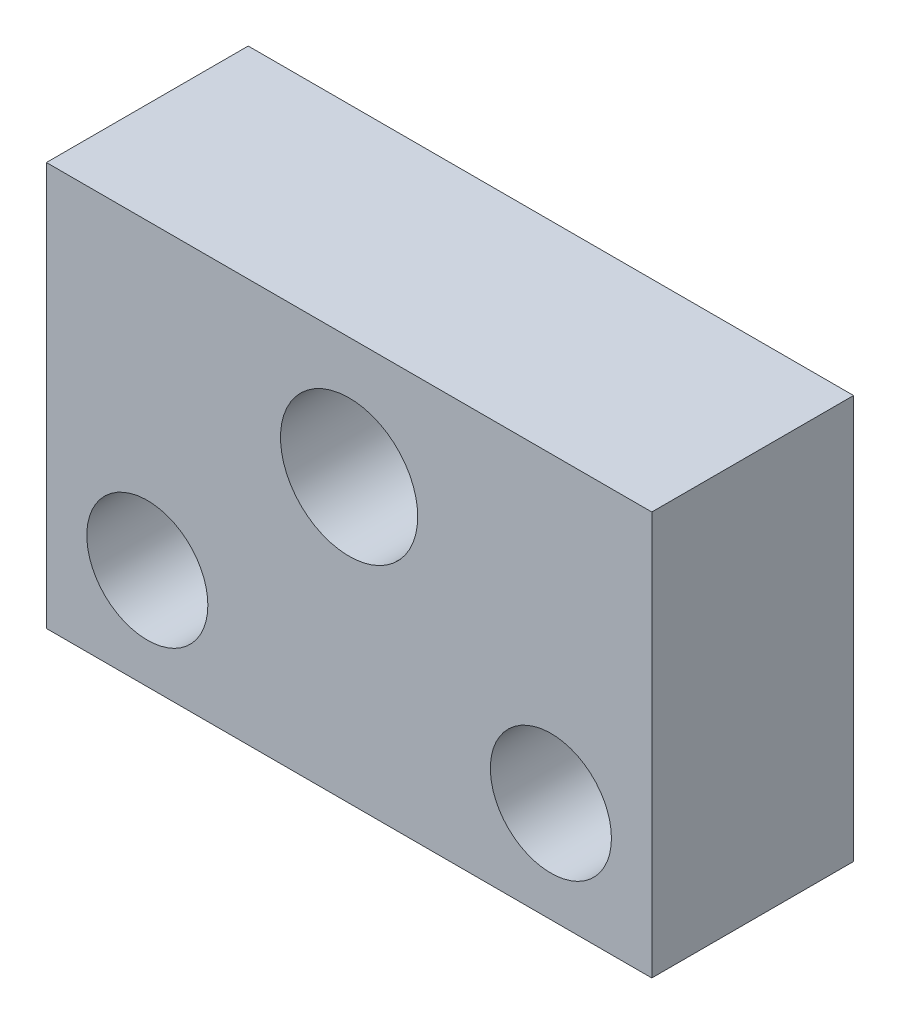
from build123d import *

# Parameters (mm, degrees)
ESQUISSE1_W            = 30
ESQUISSE1_H            = 20
ESQUISSE1_R            = 3
BOSS_EXTRU_1_DEPTH     = 10
TROU_TARAUD_M8X1_251_D = 6.8


with BuildPart() as part:
    # Esquisse1 → Boss.-Extru.1 (new body)
    with BuildSketch(Plane.XY):
        Rectangle(ESQUISSE1_W, ESQUISSE1_H)
        with Locations((-10, -5)):
            Circle(ESQUISSE1_R, mode=Mode.SUBTRACT)
        with Locations((10, -5)):
            Circle(ESQUISSE1_R, mode=Mode.SUBTRACT)
    extrude(amount=BOSS_EXTRU_1_DEPTH)

    # Trou taraud_ M8x1.251 (through all)
    with Locations(Plane.XY.offset(10)):
        with Locations((0, 4)):
            Hole(TROU_TARAUD_M8X1_251_D / 2)


solid = part.part
